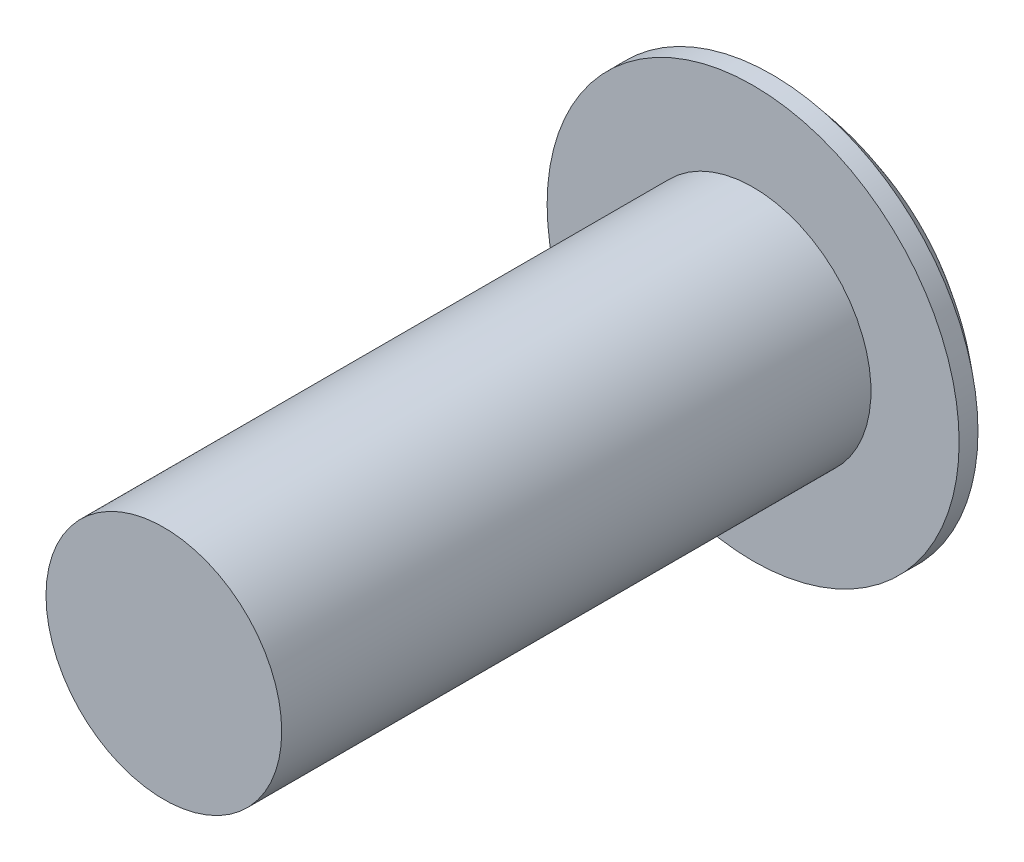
ISO-10303-21;
HEADER;
FILE_DESCRIPTION(('STEP AP214'),'2;1');
FILE_NAME('part.step','',(''),(''),'','','');
FILE_SCHEMA(('AUTOMOTIVE_DESIGN { 1 0 10303 214 1 1 1 1 }'));
ENDSEC;
DATA;
#1=APPLICATION_CONTEXT('core data for automotive mechanical design processes');
#2=APPLICATION_PROTOCOL_DEFINITION('international standard','automotive_design',2000,#1);
#3=PRODUCT_CONTEXT('',#1,'mechanical');
#4=PRODUCT('Part','Part','',(#3));
#5=PRODUCT_RELATED_PRODUCT_CATEGORY('part','',(#4));
#6=PRODUCT_DEFINITION_FORMATION('','',#4);
#7=PRODUCT_DEFINITION_CONTEXT('part definition',#1,'design');
#8=PRODUCT_DEFINITION('design','',#6,#7);
#9=PRODUCT_DEFINITION_SHAPE('','',#8);
#10=(LENGTH_UNIT() NAMED_UNIT(*) SI_UNIT(.MILLI.,.METRE.));
#11=(NAMED_UNIT(*) PLANE_ANGLE_UNIT() SI_UNIT($,.RADIAN.));
#12=(NAMED_UNIT(*) SI_UNIT($,.STERADIAN.) SOLID_ANGLE_UNIT());
#13=UNCERTAINTY_MEASURE_WITH_UNIT(LENGTH_MEASURE(1.E-05),#10,'distance_accuracy_value','');
#14=(GEOMETRIC_REPRESENTATION_CONTEXT(3) GLOBAL_UNCERTAINTY_ASSIGNED_CONTEXT((#13)) GLOBAL_UNIT_ASSIGNED_CONTEXT((#10,
#11,#12)) REPRESENTATION_CONTEXT('',''));
#15=CARTESIAN_POINT('',(0.,0.,0.));
#16=DIRECTION('',(0.,0.,1.));
#17=DIRECTION('',(1.,0.,0.));
#18=AXIS2_PLACEMENT_3D('',#15,#16,#17);
#19=CARTESIAN_POINT('',(0.,0.,0.));
#20=DIRECTION('',(0.,0.,-1.));
#21=DIRECTION('',(-1.,0.,0.));
#22=AXIS2_PLACEMENT_3D('',#19,#20,#21);
#23=PLANE('',#22);
#24=CARTESIAN_POINT('',(0.,0.,0.));
#25=DIRECTION('',(0.,0.,1.));
#26=DIRECTION('',(1.,0.,0.));
#27=AXIS2_PLACEMENT_3D('',#24,#25,#26);
#28=CIRCLE('',#27,5.5499);
#29=CARTESIAN_POINT('',(5.5499,0.,0.));
#30=VERTEX_POINT('',#29);
#31=EDGE_CURVE('E133',#30,#30,#28,.T.);
#32=ORIENTED_EDGE('',*,*,#31,.T.);
#33=EDGE_LOOP('',(#32));
#34=FACE_BOUND('',#33,.T.);
#35=CARTESIAN_POINT('',(0.,0.,0.));
#36=DIRECTION('',(0.,0.,-1.));
#37=DIRECTION('',(-1.,0.,0.));
#38=AXIS2_PLACEMENT_3D('',#35,#36,#37);
#39=CIRCLE('',#38,3.175);
#40=CARTESIAN_POINT('',(-3.175,0.,0.));
#41=VERTEX_POINT('',#40);
#42=EDGE_CURVE('E136',#41,#41,#39,.F.);
#43=ORIENTED_EDGE('',*,*,#42,.F.);
#44=EDGE_LOOP('',(#43));
#45=FACE_BOUND('',#44,.T.);
#46=ADVANCED_FACE('F34',(#34,#45),#23,.F.);
#47=CARTESIAN_POINT('',(0.,0.,0.));
#48=DIRECTION('',(0.,0.,1.));
#49=DIRECTION('',(1.,0.,0.));
#50=AXIS2_PLACEMENT_3D('',#47,#48,#49);
#51=CYLINDRICAL_SURFACE('',#50,5.5499);
#52=ORIENTED_EDGE('',*,*,#31,.F.);
#53=EDGE_LOOP('',(#52));
#54=FACE_BOUND('',#53,.T.);
#55=CARTESIAN_POINT('',(0.,0.,-0.508));
#56=DIRECTION('',(0.,0.,1.));
#57=DIRECTION('',(1.,0.,0.));
#58=AXIS2_PLACEMENT_3D('',#55,#56,#57);
#59=CIRCLE('',#58,5.5499);
#60=CARTESIAN_POINT('',(5.5499,0.,-0.508));
#61=VERTEX_POINT('',#60);
#62=EDGE_CURVE('E130',#61,#61,#59,.T.);
#63=ORIENTED_EDGE('',*,*,#62,.T.);
#64=EDGE_LOOP('',(#63));
#65=FACE_BOUND('',#64,.T.);
#66=ADVANCED_FACE('F171',(#54,#65),#51,.T.);
#67=CARTESIAN_POINT('',(0.,0.,9.02539299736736));
#68=DIRECTION('',(0.,0.,1.));
#69=DIRECTION('',(1.,0.,0.));
#70=AXIS2_PLACEMENT_3D('',#67,#68,#69);
#71=DEGENERATE_TOROIDAL_SURFACE('',#70,2.84083405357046,12.7,.F.);
#72=CARTESIAN_POINT('',(2.29037640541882,-0.0708635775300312,-2.59138067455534));
#73=CARTESIAN_POINT('',(2.25567942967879,-0.00624275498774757,-2.60758256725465));
#74=CARTESIAN_POINT('',(2.22084708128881,0.0586301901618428,-2.62247790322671));
#75=CARTESIAN_POINT('',(2.15092597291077,0.188853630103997,-2.64941897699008));
#76=CARTESIAN_POINT('',(2.11583713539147,0.254204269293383,-2.66146381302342));
#77=CARTESIAN_POINT('',(2.01022632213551,0.450897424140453,-2.69295759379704));
#78=CARTESIAN_POINT('',(1.93937398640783,0.582855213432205,-2.70775911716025));
#79=CARTESIAN_POINT('',(1.79865662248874,0.844931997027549,-2.72331205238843));
#80=CARTESIAN_POINT('',(1.72879796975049,0.975039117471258,-2.72432152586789));
#81=CARTESIAN_POINT('',(1.5893735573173,1.23470786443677,-2.71284578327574));
#82=CARTESIAN_POINT('',(1.5198076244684,1.36426981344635,-2.70037017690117));
#83=CARTESIAN_POINT('',(1.43017703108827,1.53120086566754,-2.67629611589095));
#84=CARTESIAN_POINT('',(1.40974747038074,1.56924957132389,-2.67026532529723));
#85=CARTESIAN_POINT('',(1.36896306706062,1.64520782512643,-2.65718442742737));
#86=CARTESIAN_POINT('',(1.34860821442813,1.68311739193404,-2.65013446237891));
#87=CARTESIAN_POINT('',(1.30786343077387,1.75900185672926,-2.63501613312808));
#88=CARTESIAN_POINT('',(1.28747396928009,1.79697588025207,-2.6269421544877));
#89=CARTESIAN_POINT('',(1.24678187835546,1.87276220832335,-2.60985441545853));
#90=CARTESIAN_POINT('',(1.2264792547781,1.91057450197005,-2.60084059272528));
#91=CARTESIAN_POINT('',(1.20622357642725,1.94829936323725,-2.59138067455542));
#92=B_SPLINE_CURVE_WITH_KNOTS('',3,(#72,#73,#74,#75,#76,#77,#78,#79,#80,#81,#82,#83,#84,#85,#86,
#87,#88,#89,#90,#91),.UNSPECIFIED.,.F.,.F.,(4,2,2,2,2,2,2,2,2,4),(0.,0.225322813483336,
0.450716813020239,0.901595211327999,1.34402546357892,1.78614064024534,1.9169519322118,
2.04774498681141,2.17928894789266,2.31084164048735),.UNSPECIFIED.);
#93=CARTESIAN_POINT('',(2.29026901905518,-0.0706635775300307,-2.59143082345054));
#94=VERTEX_POINT('',#93);
#95=CARTESIAN_POINT('',(1.20633096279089,1.94809936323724,-2.59143082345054));
#96=VERTEX_POINT('',#95);
#97=EDGE_CURVE('E46',#94,#96,#92,.T.);
#98=ORIENTED_EDGE('',*,*,#97,.T.);
#99=CARTESIAN_POINT('',(1.20653096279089,1.94809319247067,-2.59138662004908));
#100=CARTESIAN_POINT('',(1.13321953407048,1.95035513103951,-2.60758810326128));
#101=CARTESIAN_POINT('',(1.05962208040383,1.95262589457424,-2.62248302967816));
#102=CARTESIAN_POINT('',(0.9118854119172,1.95718413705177,-2.64942328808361));
#103=CARTESIAN_POINT('',(0.837746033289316,1.95947162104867,-2.66146771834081));
#104=CARTESIAN_POINT('',(0.614600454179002,1.96635651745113,-2.69296029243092));
#105=CARTESIAN_POINT('',(0.464896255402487,1.97097546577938,-2.7077610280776));
#106=CARTESIAN_POINT('',(0.167573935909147,1.98014899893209,-2.72331251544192));
#107=CARTESIAN_POINT('',(0.0199692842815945,1.98470316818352,-2.7243213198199));
#108=CARTESIAN_POINT('',(-0.274621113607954,1.99379241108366,-2.71284440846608));
#109=CARTESIAN_POINT('',(-0.421607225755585,1.99832749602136,-2.70036830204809));
#110=CARTESIAN_POINT('',(-0.610984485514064,2.00417051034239,-2.67629416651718));
#111=CARTESIAN_POINT('',(-0.654146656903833,2.00550222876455,-2.67026380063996));
#112=CARTESIAN_POINT('',(-0.740313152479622,2.00816079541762,-2.65718393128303));
#113=CARTESIAN_POINT('',(-0.783317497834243,2.00948764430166,-2.6501345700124));
#114=CARTESIAN_POINT('',(-0.869400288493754,2.01214362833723,-2.63501762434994));
#115=CARTESIAN_POINT('',(-0.912477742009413,2.01347273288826,-2.62694442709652));
#116=CARTESIAN_POINT('',(-0.998449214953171,2.01612528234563,-2.60985840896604));
#117=CARTESIAN_POINT('',(-1.04134322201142,2.01744872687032,-2.60084552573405));
#118=CARTESIAN_POINT('',(-1.0841380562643,2.01876911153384,-2.59138662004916));
#119=B_SPLINE_CURVE_WITH_KNOTS('',3,(#99,#100,#101,#102,#103,#104,#105,#106,#107,#108,#109,#110,
#111,#112,#113,#114,#115,#116,#117,#118),.UNSPECIFIED.,.F.,.F.,(4,2,2,2,2,2,2,2,2,4),(0.,
0.225321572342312,0.450714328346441,0.901590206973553,1.34401821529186,1.78613115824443,
1.9169311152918,2.04771283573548,2.17924531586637,2.31078652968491),.UNSPECIFIED.);
#120=CARTESIAN_POINT('',(-1.08393805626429,2.01876294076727,-2.59143082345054));
#121=VERTEX_POINT('',#120);
#122=EDGE_CURVE('E11',#96,#121,#119,.T.);
#123=ORIENTED_EDGE('',*,*,#122,.T.);
#124=CARTESIAN_POINT('',(-1.08381420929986,2.01896294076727,-2.59137885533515));
#125=CARTESIAN_POINT('',(-1.12242904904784,1.9566039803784,-2.60758087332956));
#126=CARTESIAN_POINT('',(-1.16119454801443,1.89400172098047,-2.62247633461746));
#127=CARTESIAN_POINT('',(-1.23901091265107,1.76833636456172,-2.64941765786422));
#128=CARTESIAN_POINT('',(-1.27806186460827,1.70527312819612,-2.66146261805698));
#129=CARTESIAN_POINT('',(-1.39559790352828,1.51546461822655,-2.69295676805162));
#130=CARTESIAN_POINT('',(-1.47445065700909,1.3881256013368,-2.70775853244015));
#131=CARTESIAN_POINT('',(-1.63105737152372,1.13522200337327,-2.72331191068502));
#132=CARTESIAN_POINT('',(-1.70880423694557,1.00966888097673,-2.72432158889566));
#133=CARTESIAN_POINT('',(-1.86397201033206,0.759089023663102,-2.71284620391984));
#134=CARTESIAN_POINT('',(-1.94139311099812,0.634061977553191,-2.7003707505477));
#135=CARTESIAN_POINT('',(-2.04114508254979,0.47297289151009,-2.67629671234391));
#136=CARTESIAN_POINT('',(-2.06388205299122,0.436255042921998,-2.67026579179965));
#137=CARTESIAN_POINT('',(-2.10927283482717,0.362953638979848,-2.65718457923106));
#138=CARTESIAN_POINT('',(-2.13192665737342,0.326370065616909,-2.65013442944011));
#139=CARTESIAN_POINT('',(-2.1772733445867,0.253139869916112,-2.6350156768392));
#140=CARTESIAN_POINT('',(-2.19996568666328,0.216494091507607,-2.62694145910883));
#141=CARTESIAN_POINT('',(-2.24525372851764,0.143358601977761,-2.60985319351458));
#142=CARTESIAN_POINT('',(-2.26784942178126,0.106868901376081,-2.60083908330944));
#143=CARTESIAN_POINT('',(-2.29039286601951,0.0704635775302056,-2.59137885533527));
#144=B_SPLINE_CURVE_WITH_KNOTS('',3,(#124,#125,#126,#127,#128,#129,#130,#131,#132,#133,#134,
#135,#136,#137,#138,#139,#140,#141,#142,#143),.UNSPECIFIED.,.F.,.F.,(4,2,2,2,2,2,2,2,2,4),(0.,
0.225323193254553,0.450717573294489,0.901596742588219,1.34402768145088,1.7861435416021,
1.91695830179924,2.04775482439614,2.17930229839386,2.31085850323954),.UNSPECIFIED.);
#145=CARTESIAN_POINT('',(-2.29026901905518,0.0706635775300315,-2.59143082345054));
#146=VERTEX_POINT('',#145);
#147=EDGE_CURVE('E92',#121,#146,#144,.T.);
#148=ORIENTED_EDGE('',*,*,#147,.T.);
#149=CARTESIAN_POINT('',(-2.29037640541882,0.0708635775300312,-2.59138067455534));
#150=CARTESIAN_POINT('',(-2.25567942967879,0.00624275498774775,-2.60758256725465));
#151=CARTESIAN_POINT('',(-2.22084708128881,-0.0586301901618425,-2.62247790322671));
#152=CARTESIAN_POINT('',(-2.15092597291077,-0.188853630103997,-2.64941897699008));
#153=CARTESIAN_POINT('',(-2.11583713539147,-0.254204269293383,-2.66146381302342));
#154=CARTESIAN_POINT('',(-2.01022632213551,-0.450897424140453,-2.69295759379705));
#155=CARTESIAN_POINT('',(-1.93937398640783,-0.582855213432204,-2.70775911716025));
#156=CARTESIAN_POINT('',(-1.79865662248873,-0.844931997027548,-2.72331205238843));
#157=CARTESIAN_POINT('',(-1.72879796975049,-0.975039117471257,-2.72432152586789));
#158=CARTESIAN_POINT('',(-1.58937355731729,-1.23470786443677,-2.71284578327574));
#159=CARTESIAN_POINT('',(-1.5198076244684,-1.36426981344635,-2.70037017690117));
#160=CARTESIAN_POINT('',(-1.43017703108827,-1.53120086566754,-2.67629611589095));
#161=CARTESIAN_POINT('',(-1.40974747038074,-1.56924957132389,-2.67026532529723));
#162=CARTESIAN_POINT('',(-1.36896306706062,-1.64520782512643,-2.65718442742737));
#163=CARTESIAN_POINT('',(-1.34860821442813,-1.68311739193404,-2.65013446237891));
#164=CARTESIAN_POINT('',(-1.30786343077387,-1.75900185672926,-2.63501613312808));
#165=CARTESIAN_POINT('',(-1.28747396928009,-1.79697588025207,-2.6269421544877));
#166=CARTESIAN_POINT('',(-1.24678187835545,-1.87276220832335,-2.60985441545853));
#167=CARTESIAN_POINT('',(-1.2264792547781,-1.91057450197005,-2.60084059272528));
#168=CARTESIAN_POINT('',(-1.20622357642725,-1.94829936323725,-2.59138067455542));
#169=B_SPLINE_CURVE_WITH_KNOTS('',3,(#149,#150,#151,#152,#153,#154,#155,#156,#157,#158,#159,
#160,#161,#162,#163,#164,#165,#166,#167,#168),.UNSPECIFIED.,.F.,.F.,(4,2,2,2,2,2,2,2,2,4),(0.,
0.225322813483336,0.450716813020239,0.901595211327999,1.34402546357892,1.78614064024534,
1.9169519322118,2.04774498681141,2.17928894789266,2.31084164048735),.UNSPECIFIED.);
#170=CARTESIAN_POINT('',(-1.20633096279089,-1.94809936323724,-2.59143082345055));
#171=VERTEX_POINT('',#170);
#172=EDGE_CURVE('E144',#146,#171,#169,.T.);
#173=ORIENTED_EDGE('',*,*,#172,.T.);
#174=CARTESIAN_POINT('',(-1.20653096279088,-1.94809319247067,-2.59138662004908));
#175=CARTESIAN_POINT('',(-1.13321953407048,-1.95035513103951,-2.60758810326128));
#176=CARTESIAN_POINT('',(-1.05962208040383,-1.95262589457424,-2.62248302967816));
#177=CARTESIAN_POINT('',(-0.911885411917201,-1.95718413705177,-2.64942328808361));
#178=CARTESIAN_POINT('',(-0.837746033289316,-1.95947162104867,-2.66146771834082));
#179=CARTESIAN_POINT('',(-0.614600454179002,-1.96635651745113,-2.69296029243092));
#180=CARTESIAN_POINT('',(-0.464896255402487,-1.97097546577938,-2.7077610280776));
#181=CARTESIAN_POINT('',(-0.167573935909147,-1.98014899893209,-2.72331251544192));
#182=CARTESIAN_POINT('',(-0.0199692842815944,-1.98470316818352,-2.7243213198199));
#183=CARTESIAN_POINT('',(0.274621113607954,-1.99379241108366,-2.71284440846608));
#184=CARTESIAN_POINT('',(0.421607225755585,-1.99832749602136,-2.70036830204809));
#185=CARTESIAN_POINT('',(0.610984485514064,-2.00417051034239,-2.67629416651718));
#186=CARTESIAN_POINT('',(0.654146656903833,-2.00550222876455,-2.67026380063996));
#187=CARTESIAN_POINT('',(0.740313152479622,-2.00816079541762,-2.65718393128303));
#188=CARTESIAN_POINT('',(0.783317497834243,-2.00948764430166,-2.6501345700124));
#189=CARTESIAN_POINT('',(0.869400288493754,-2.01214362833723,-2.63501762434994));
#190=CARTESIAN_POINT('',(0.912477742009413,-2.01347273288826,-2.62694442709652));
#191=CARTESIAN_POINT('',(0.998449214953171,-2.01612528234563,-2.60985840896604));
#192=CARTESIAN_POINT('',(1.04134322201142,-2.01744872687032,-2.60084552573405));
#193=CARTESIAN_POINT('',(1.0841380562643,-2.01876911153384,-2.59138662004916));
#194=B_SPLINE_CURVE_WITH_KNOTS('',3,(#174,#175,#176,#177,#178,#179,#180,#181,#182,#183,#184,
#185,#186,#187,#188,#189,#190,#191,#192,#193),.UNSPECIFIED.,.F.,.F.,(4,2,2,2,2,2,2,2,2,4),(0.,
0.225321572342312,0.45071432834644,0.901590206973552,1.34401821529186,1.78613115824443,
1.9169311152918,2.04771283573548,2.17924531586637,2.31078652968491),.UNSPECIFIED.);
#195=CARTESIAN_POINT('',(1.08393805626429,-2.01876294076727,-2.59143082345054));
#196=VERTEX_POINT('',#195);
#197=EDGE_CURVE('E283',#171,#196,#194,.T.);
#198=ORIENTED_EDGE('',*,*,#197,.T.);
#199=CARTESIAN_POINT('',(1.08381420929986,-2.01896294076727,-2.59137885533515));
#200=CARTESIAN_POINT('',(1.12242904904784,-1.9566039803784,-2.60758087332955));
#201=CARTESIAN_POINT('',(1.16119454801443,-1.89400172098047,-2.62247633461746));
#202=CARTESIAN_POINT('',(1.23901091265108,-1.76833636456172,-2.64941765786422));
#203=CARTESIAN_POINT('',(1.27806186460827,-1.70527312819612,-2.66146261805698));
#204=CARTESIAN_POINT('',(1.39559790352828,-1.51546461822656,-2.69295676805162));
#205=CARTESIAN_POINT('',(1.47445065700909,-1.3881256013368,-2.70775853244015));
#206=CARTESIAN_POINT('',(1.63105737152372,-1.13522200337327,-2.72331191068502));
#207=CARTESIAN_POINT('',(1.70880423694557,-1.00966888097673,-2.72432158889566));
#208=CARTESIAN_POINT('',(1.86397201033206,-0.759089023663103,-2.71284620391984));
#209=CARTESIAN_POINT('',(1.94139311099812,-0.634061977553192,-2.7003707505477));
#210=CARTESIAN_POINT('',(2.04114508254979,-0.472972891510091,-2.67629671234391));
#211=CARTESIAN_POINT('',(2.06388205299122,-0.436255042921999,-2.67026579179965));
#212=CARTESIAN_POINT('',(2.10927283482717,-0.362953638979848,-2.65718457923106));
#213=CARTESIAN_POINT('',(2.13192665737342,-0.326370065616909,-2.65013442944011));
#214=CARTESIAN_POINT('',(2.1772733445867,-0.253139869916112,-2.6350156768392));
#215=CARTESIAN_POINT('',(2.19996568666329,-0.216494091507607,-2.62694145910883));
#216=CARTESIAN_POINT('',(2.24525372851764,-0.14335860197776,-2.60985319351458));
#217=CARTESIAN_POINT('',(2.26784942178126,-0.106868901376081,-2.60083908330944));
#218=CARTESIAN_POINT('',(2.29039286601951,-0.0704635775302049,-2.59137885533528));
#219=B_SPLINE_CURVE_WITH_KNOTS('',3,(#199,#200,#201,#202,#203,#204,#205,#206,#207,#208,#209,
#210,#211,#212,#213,#214,#215,#216,#217,#218),.UNSPECIFIED.,.F.,.F.,(4,2,2,2,2,2,2,2,2,4),(0.,
0.225323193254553,0.450717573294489,0.901596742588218,1.34402768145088,1.7861435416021,
1.91695830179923,2.04775482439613,2.17930229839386,2.31085850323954),.UNSPECIFIED.);
#220=EDGE_CURVE('E278',#196,#94,#219,.T.);
#221=ORIENTED_EDGE('',*,*,#220,.T.);
#222=EDGE_LOOP('',(#98,#123,#148,#173,#198,#221));
#223=FACE_BOUND('',#222,.T.);
#224=ORIENTED_EDGE('',*,*,#62,.F.);
#225=EDGE_LOOP('',(#224));
#226=FACE_BOUND('',#225,.T.);
#227=ADVANCED_FACE('F150',(#223,#226),#71,.F.);
#228=CARTESIAN_POINT('',(0.,0.,15.875));
#229=DIRECTION('',(0.,0.,-1.));
#230=DIRECTION('',(-1.,0.,0.));
#231=AXIS2_PLACEMENT_3D('',#228,#229,#230);
#232=CYLINDRICAL_SURFACE('',#231,3.175);
#233=CARTESIAN_POINT('',(0.,0.,15.875));
#234=DIRECTION('',(0.,0.,1.));
#235=DIRECTION('',(1.,0.,0.));
#236=AXIS2_PLACEMENT_3D('',#233,#234,#235);
#237=CIRCLE('',#236,3.175);
#238=CARTESIAN_POINT('',(3.175,0.,15.875));
#239=VERTEX_POINT('',#238);
#240=EDGE_CURVE('E120',#239,#239,#237,.T.);
#241=ORIENTED_EDGE('',*,*,#240,.F.);
#242=EDGE_LOOP('',(#241));
#243=FACE_BOUND('',#242,.T.);
#244=ORIENTED_EDGE('',*,*,#42,.T.);
#245=EDGE_LOOP('',(#244));
#246=FACE_BOUND('',#245,.T.);
#247=ADVANCED_FACE('F164',(#243,#246),#232,.T.);
#248=CARTESIAN_POINT('',(0.,0.,15.875));
#249=DIRECTION('',(0.,0.,1.));
#250=DIRECTION('',(1.,0.,0.));
#251=AXIS2_PLACEMENT_3D('',#248,#249,#250);
#252=PLANE('',#251);
#253=ORIENTED_EDGE('',*,*,#240,.T.);
#254=EDGE_LOOP('',(#253));
#255=FACE_BOUND('',#254,.T.);
#256=ADVANCED_FACE('F162',(#255),#252,.T.);
#257=CARTESIAN_POINT('',(1.20633096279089,1.94809936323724,-6.35));
#258=DIRECTION('',(0.0308391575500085,0.999524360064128,0.));
#259=DIRECTION('',(-0.999524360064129,0.0308391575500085,0.));
#260=AXIS2_PLACEMENT_3D('',#257,#258,#259);
#261=PLANE('',#260);
#262=DIRECTION('',(0.,0.,1.));
#263=VECTOR('',#262,1.);
#264=CARTESIAN_POINT('',(1.20633096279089,1.94809936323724,-6.35));
#265=LINE('',#264,#263);
#266=CARTESIAN_POINT('',(1.20633096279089,1.94809936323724,0.));
#267=VERTEX_POINT('',#266);
#268=EDGE_CURVE('E108',#96,#267,#265,.T.);
#269=ORIENTED_EDGE('',*,*,#268,.T.);
#270=DIRECTION('',(-0.999524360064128,0.0308391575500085,0.));
#271=VECTOR('',#270,1.);
#272=CARTESIAN_POINT('',(1.20633096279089,1.94809936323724,0.));
#273=LINE('',#272,#271);
#274=CARTESIAN_POINT('',(-1.08393805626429,2.01876294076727,0.));
#275=VERTEX_POINT('',#274);
#276=EDGE_CURVE('E101',#267,#275,#273,.T.);
#277=ORIENTED_EDGE('',*,*,#276,.T.);
#278=DIRECTION('',(0.,0.,1.));
#279=VECTOR('',#278,1.);
#280=CARTESIAN_POINT('',(-1.08393805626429,2.01876294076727,-6.35));
#281=LINE('',#280,#279);
#282=EDGE_CURVE('E87',#121,#275,#281,.T.);
#283=ORIENTED_EDGE('',*,*,#282,.F.);
#284=ORIENTED_EDGE('',*,*,#122,.F.);
#285=EDGE_LOOP('',(#269,#277,#283,#284));
#286=FACE_BOUND('',#285,.T.);
#287=ADVANCED_FACE('F107',(#286),#261,.F.);
#288=CARTESIAN_POINT('',(2.29026901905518,-0.0706635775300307,-6.35));
#289=DIRECTION('',(0.881033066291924,0.473054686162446,0.));
#290=DIRECTION('',(-0.473054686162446,0.881033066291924,0.));
#291=AXIS2_PLACEMENT_3D('',#288,#289,#290);
#292=PLANE('',#291);
#293=DIRECTION('',(0.,0.,1.));
#294=VECTOR('',#293,1.);
#295=CARTESIAN_POINT('',(2.29026901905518,-0.0706635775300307,-6.35));
#296=LINE('',#295,#294);
#297=CARTESIAN_POINT('',(2.29026901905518,-0.0706635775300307,0.));
#298=VERTEX_POINT('',#297);
#299=EDGE_CURVE('E121',#94,#298,#296,.T.);
#300=ORIENTED_EDGE('',*,*,#299,.T.);
#301=DIRECTION('',(-0.473054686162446,0.881033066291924,0.));
#302=VECTOR('',#301,1.);
#303=CARTESIAN_POINT('',(2.29026901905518,-0.0706635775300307,0.));
#304=LINE('',#303,#302);
#305=EDGE_CURVE('E94',#298,#267,#304,.T.);
#306=ORIENTED_EDGE('',*,*,#305,.T.);
#307=ORIENTED_EDGE('',*,*,#268,.F.);
#308=ORIENTED_EDGE('',*,*,#97,.F.);
#309=EDGE_LOOP('',(#300,#306,#307,#308));
#310=FACE_BOUND('',#309,.T.);
#311=ADVANCED_FACE('F161',(#310),#292,.F.);
#312=CARTESIAN_POINT('',(1.08393805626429,-2.01876294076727,-6.35));
#313=DIRECTION('',(0.850193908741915,-0.526469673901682,0.));
#314=DIRECTION('',(0.526469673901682,0.850193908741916,0.));
#315=AXIS2_PLACEMENT_3D('',#312,#313,#314);
#316=PLANE('',#315);
#317=DIRECTION('',(0.,0.,1.));
#318=VECTOR('',#317,1.);
#319=CARTESIAN_POINT('',(1.08393805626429,-2.01876294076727,-6.35));
#320=LINE('',#319,#318);
#321=CARTESIAN_POINT('',(1.08393805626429,-2.01876294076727,0.));
#322=VERTEX_POINT('',#321);
#323=EDGE_CURVE('E123',#196,#322,#320,.T.);
#324=ORIENTED_EDGE('',*,*,#323,.T.);
#325=DIRECTION('',(0.526469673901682,0.850193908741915,0.));
#326=VECTOR('',#325,1.);
#327=CARTESIAN_POINT('',(1.08393805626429,-2.01876294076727,0.));
#328=LINE('',#327,#326);
#329=EDGE_CURVE('E115',#322,#298,#328,.T.);
#330=ORIENTED_EDGE('',*,*,#329,.T.);
#331=ORIENTED_EDGE('',*,*,#299,.F.);
#332=ORIENTED_EDGE('',*,*,#220,.F.);
#333=EDGE_LOOP('',(#324,#330,#331,#332));
#334=FACE_BOUND('',#333,.T.);
#335=ADVANCED_FACE('F223',(#334),#316,.F.);
#336=CARTESIAN_POINT('',(-1.20633096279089,-1.94809936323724,-6.35));
#337=DIRECTION('',(-0.0308391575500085,-0.999524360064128,0.));
#338=DIRECTION('',(0.999524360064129,-0.0308391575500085,0.));
#339=AXIS2_PLACEMENT_3D('',#336,#337,#338);
#340=PLANE('',#339);
#341=DIRECTION('',(0.,0.,1.));
#342=VECTOR('',#341,1.);
#343=CARTESIAN_POINT('',(-1.20633096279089,-1.94809936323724,-6.35));
#344=LINE('',#343,#342);
#345=CARTESIAN_POINT('',(-1.20633096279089,-1.94809936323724,0.));
#346=VERTEX_POINT('',#345);
#347=EDGE_CURVE('E125',#171,#346,#344,.T.);
#348=ORIENTED_EDGE('',*,*,#347,.T.);
#349=DIRECTION('',(0.999524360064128,-0.0308391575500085,0.));
#350=VECTOR('',#349,1.);
#351=CARTESIAN_POINT('',(-1.20633096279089,-1.94809936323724,0.));
#352=LINE('',#351,#350);
#353=EDGE_CURVE('E112',#346,#322,#352,.T.);
#354=ORIENTED_EDGE('',*,*,#353,.T.);
#355=ORIENTED_EDGE('',*,*,#323,.F.);
#356=ORIENTED_EDGE('',*,*,#197,.F.);
#357=EDGE_LOOP('',(#348,#354,#355,#356));
#358=FACE_BOUND('',#357,.T.);
#359=ADVANCED_FACE('F231',(#358),#340,.F.);
#360=CARTESIAN_POINT('',(-2.29026901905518,0.0706635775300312,-6.35));
#361=DIRECTION('',(-0.881033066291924,-0.473054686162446,0.));
#362=DIRECTION('',(0.473054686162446,-0.881033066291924,0.));
#363=AXIS2_PLACEMENT_3D('',#360,#361,#362);
#364=PLANE('',#363);
#365=DIRECTION('',(0.,0.,1.));
#366=VECTOR('',#365,1.);
#367=CARTESIAN_POINT('',(-2.29026901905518,0.0706635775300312,-6.35));
#368=LINE('',#367,#366);
#369=CARTESIAN_POINT('',(-2.29026901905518,0.0706635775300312,0.));
#370=VERTEX_POINT('',#369);
#371=EDGE_CURVE('E53',#146,#370,#368,.T.);
#372=ORIENTED_EDGE('',*,*,#371,.T.);
#373=DIRECTION('',(0.473054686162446,-0.881033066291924,0.));
#374=VECTOR('',#373,1.);
#375=CARTESIAN_POINT('',(-2.29026901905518,0.0706635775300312,0.));
#376=LINE('',#375,#374);
#377=EDGE_CURVE('E105',#370,#346,#376,.T.);
#378=ORIENTED_EDGE('',*,*,#377,.T.);
#379=ORIENTED_EDGE('',*,*,#347,.F.);
#380=ORIENTED_EDGE('',*,*,#172,.F.);
#381=EDGE_LOOP('',(#372,#378,#379,#380));
#382=FACE_BOUND('',#381,.T.);
#383=ADVANCED_FACE('F155',(#382),#364,.F.);
#384=CARTESIAN_POINT('',(-1.08393805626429,2.01876294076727,-6.35));
#385=DIRECTION('',(-0.850193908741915,0.526469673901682,0.));
#386=DIRECTION('',(-0.526469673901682,-0.850193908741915,0.));
#387=AXIS2_PLACEMENT_3D('',#384,#385,#386);
#388=PLANE('',#387);
#389=ORIENTED_EDGE('',*,*,#282,.T.);
#390=DIRECTION('',(-0.526469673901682,-0.850193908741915,0.));
#391=VECTOR('',#390,1.);
#392=CARTESIAN_POINT('',(-1.08393805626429,2.01876294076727,0.));
#393=LINE('',#392,#391);
#394=EDGE_CURVE('E90',#275,#370,#393,.T.);
#395=ORIENTED_EDGE('',*,*,#394,.T.);
#396=ORIENTED_EDGE('',*,*,#371,.F.);
#397=ORIENTED_EDGE('',*,*,#147,.F.);
#398=EDGE_LOOP('',(#389,#395,#396,#397));
#399=FACE_BOUND('',#398,.T.);
#400=ADVANCED_FACE('F89',(#399),#388,.F.);
#401=CARTESIAN_POINT('',(-1.08393805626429,2.01876294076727,0.));
#402=DIRECTION('',(0.,0.,1.));
#403=DIRECTION('',(1.,0.,0.));
#404=AXIS2_PLACEMENT_3D('',#401,#402,#403);
#405=PLANE('',#404);
#406=ORIENTED_EDGE('',*,*,#276,.F.);
#407=ORIENTED_EDGE('',*,*,#305,.F.);
#408=ORIENTED_EDGE('',*,*,#329,.F.);
#409=ORIENTED_EDGE('',*,*,#353,.F.);
#410=ORIENTED_EDGE('',*,*,#377,.F.);
#411=ORIENTED_EDGE('',*,*,#394,.F.);
#412=EDGE_LOOP('',(#406,#407,#408,#409,#410,#411));
#413=FACE_BOUND('',#412,.T.);
#414=ADVANCED_FACE('F99',(#413),#405,.F.);
#415=CLOSED_SHELL('',(#46,#66,#227,#247,#256,#287,#311,#335,#359,#383,#400,#414));
#416=MANIFOLD_SOLID_BREP('B2',#415);
#417=ADVANCED_BREP_SHAPE_REPRESENTATION('',(#18,#416),#14);
#418=SHAPE_DEFINITION_REPRESENTATION(#9,#417);
ENDSEC;
END-ISO-10303-21;
